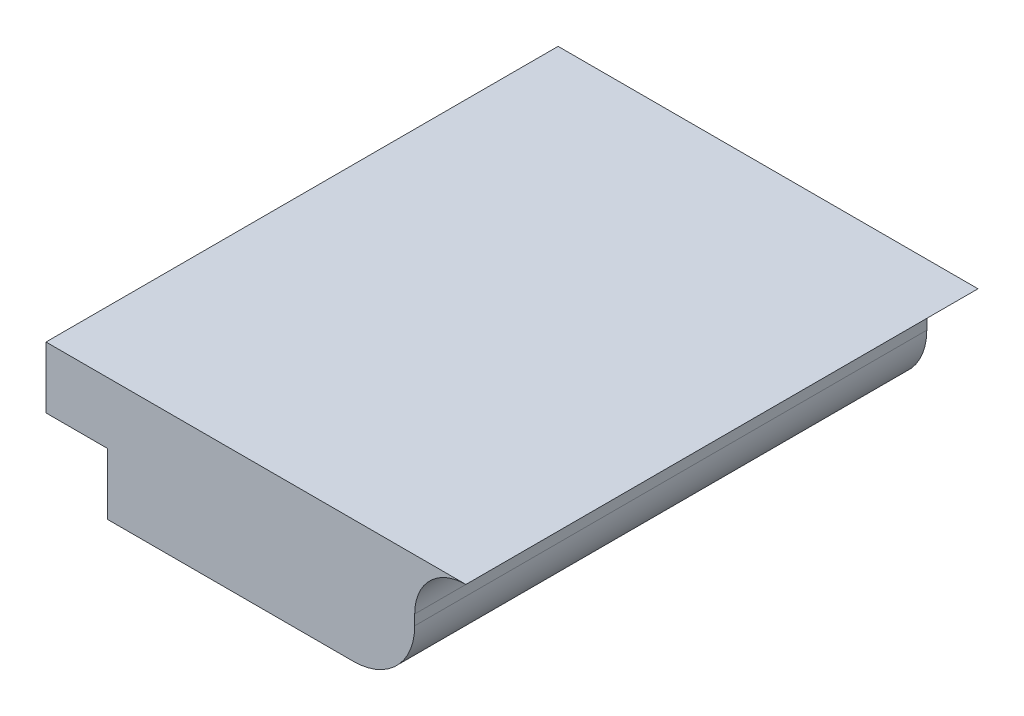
from build123d import *

# Parameters (mm, degrees)
SKETCH1_W          = 50
SKETCH1_H          = 5
BASE_EXTRUDE_DEPTH = 25
LANCE_TOOL_DEPTH   = 12.5
INSIDE_FILLET_R    = 2.5
ROUND_2_R          = 3
SKETCH3_W          = 50
SKETCH3_H          = 5
CUT_EXTRUDE1_DEPTH = 57.222771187


with BuildPart() as part:
    # Sketch1 → Base-Extrude (new, symmetric)
    with BuildSketch(Plane.XY):
        with Locations((0, 2.5)):
            Rectangle(SKETCH1_W, SKETCH1_H)
    extrude(amount=BASE_EXTRUDE_DEPTH, both=True)

    # Lance Tool sketch → Lance Tool (add, symmetric)
    with BuildSketch(Plane.XY):
        Polygon((9, 0), (-9, 0), (-9, -3), (-6, -3), (-6, -6), (9, -6), align=None)
    extrude(amount=LANCE_TOOL_DEPTH, both=True)

    # Inside Fillet
    inside_fillet_edges = [part.edges().sort_by_distance(p)[0] for p in [
        (9, 0, 0),
    ]]
    fillet(inside_fillet_edges, radius=INSIDE_FILLET_R)

    # Round 2
    round_2_edges = [part.edges().sort_by_distance(p)[0] for p in [
        (9, -6, 0),
    ]]
    fillet(round_2_edges, radius=ROUND_2_R)

    # Sketch3 → Cut-Extrude1 (cut, through all)
    with BuildSketch(Plane(origin=(25, 0, 0), x_dir=(0, 0, -1), z_dir=(1, 0, 0))):
        with Locations((0, 2.5)):
            Rectangle(SKETCH3_W, SKETCH3_H)
    extrude(amount=-CUT_EXTRUDE1_DEPTH, mode=Mode.SUBTRACT)


solid = part.part
